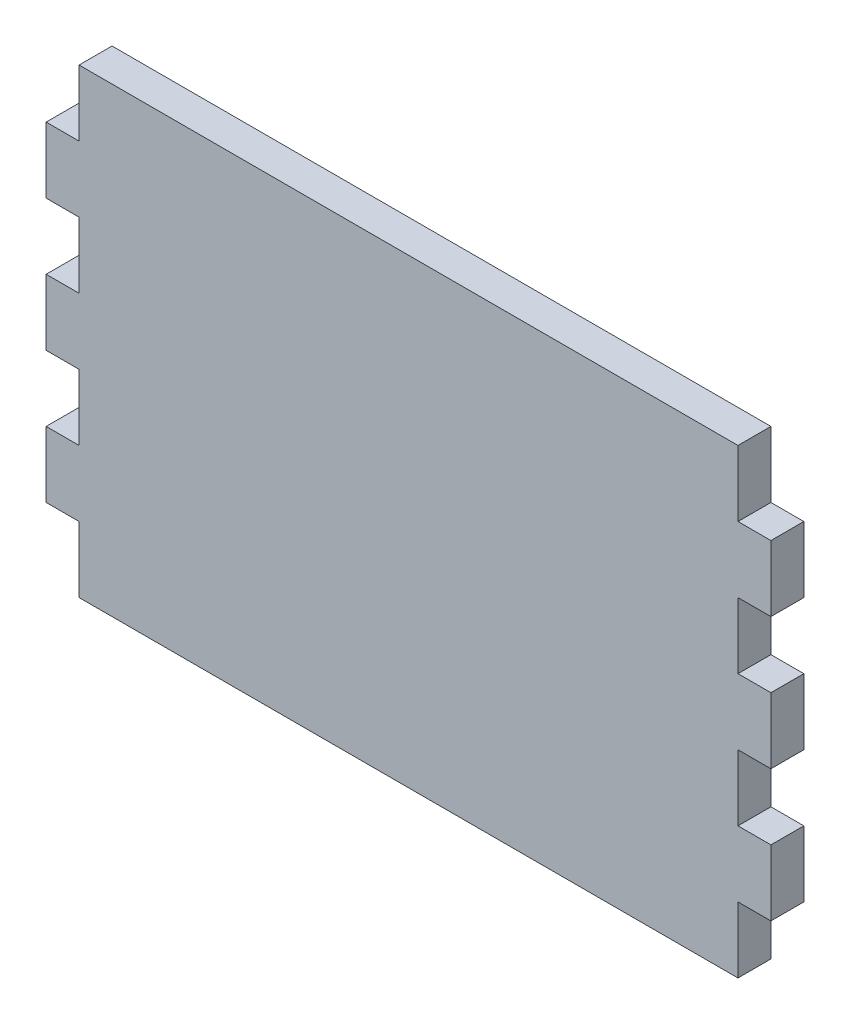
from build123d import *

# Parameters (mm, degrees)
ESQUISSE1_W             = 100
ESQUISSE1_H             = 70
BOSS_EXTRU_1_DEPTH      = 5
BOSS_EXTRU_2_DEPTH      = 5
BOSS_EXTRU_2_DEPTH_BACK = 105
ESQUISSE2_W             = 5
ESQUISSE2_H             = 10


with BuildPart() as part:
    # Esquisse1 → Boss.-Extru.1 (new body)
    with BuildSketch(Plane.XY):
        Rectangle(ESQUISSE1_W, ESQUISSE1_H)
    extrude(amount=BOSS_EXTRU_1_DEPTH)

    # Esquisse2 → Boss.-Extru.2 (add, two sides: drawn at the far end of the back side and taken through both)
    with BuildSketch(Plane(origin=(50, 0, 0), x_dir=(0, 0, -1), z_dir=(1, 0, 0)).offset(-BOSS_EXTRU_2_DEPTH_BACK)):
        with Locations((-2.5, -20)):
            Rectangle(ESQUISSE2_W, ESQUISSE2_H)
        with Locations((-2.5, 0)):
            Rectangle(ESQUISSE2_W, ESQUISSE2_H)
        with Locations((-2.5, 20)):
            Rectangle(ESQUISSE2_W, ESQUISSE2_H)
    extrude(amount=BOSS_EXTRU_2_DEPTH + BOSS_EXTRU_2_DEPTH_BACK)


solid = part.part
